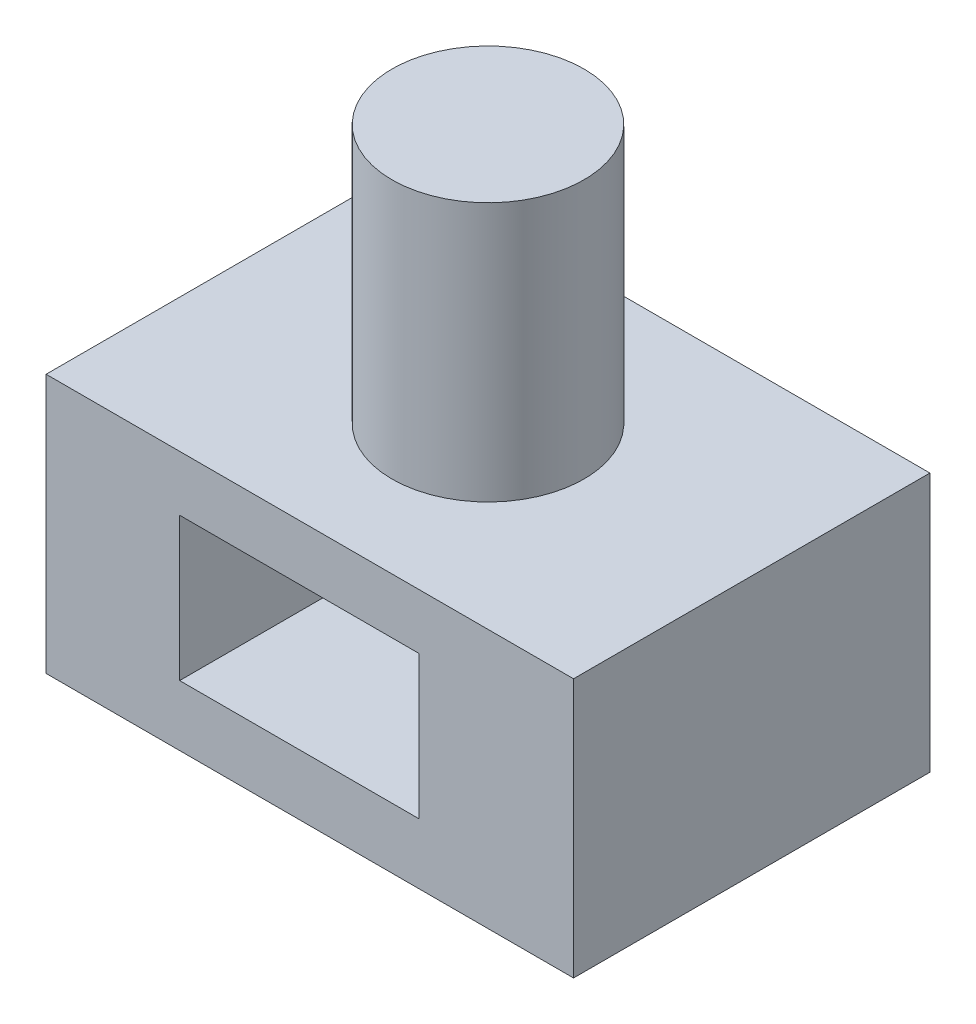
from build123d import *

# Parameters (mm, degrees)
SKETCH1_W           = 122.115526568
SKETCH1_H           = 82.502729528
BOSS_EXTRUDE1_DEPTH = 60
SKETCH2_R           = 22.234028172
BOSS_EXTRUDE2_DEPTH = 60
SKETCH3_W           = 55.426256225
SKETCH3_H           = 33.152463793
CUT_EXTRUDE1_DEPTH  = 60


with BuildPart() as part:
    # Sketch1 → Boss-Extrude1 (new body)
    with BuildSketch(Plane(origin=(0, 0, 0), x_dir=(1, 0, 0), z_dir=(0, 1, 0))):
        Rectangle(SKETCH1_W, SKETCH1_H)
    extrude(amount=BOSS_EXTRUDE1_DEPTH)

    # Sketch2 → Boss-Extrude2 (add)
    with BuildSketch(Plane(origin=(0, 60, 0), x_dir=(1, 0, 0), z_dir=(0, 1, 0))):
        with Locations(Location((0, 0, 0), (0, 0, 90))):
            Circle(SKETCH2_R)
    extrude(amount=BOSS_EXTRUDE2_DEPTH)

    # Sketch3 → Cut-Extrude1 (cut)
    with BuildSketch(Plane.XY.offset(41.251364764)):
        with Locations((-2.427212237, 30.609338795)):
            Rectangle(SKETCH3_W, SKETCH3_H)
    extrude(amount=-CUT_EXTRUDE1_DEPTH, mode=Mode.SUBTRACT)


solid = part.part
